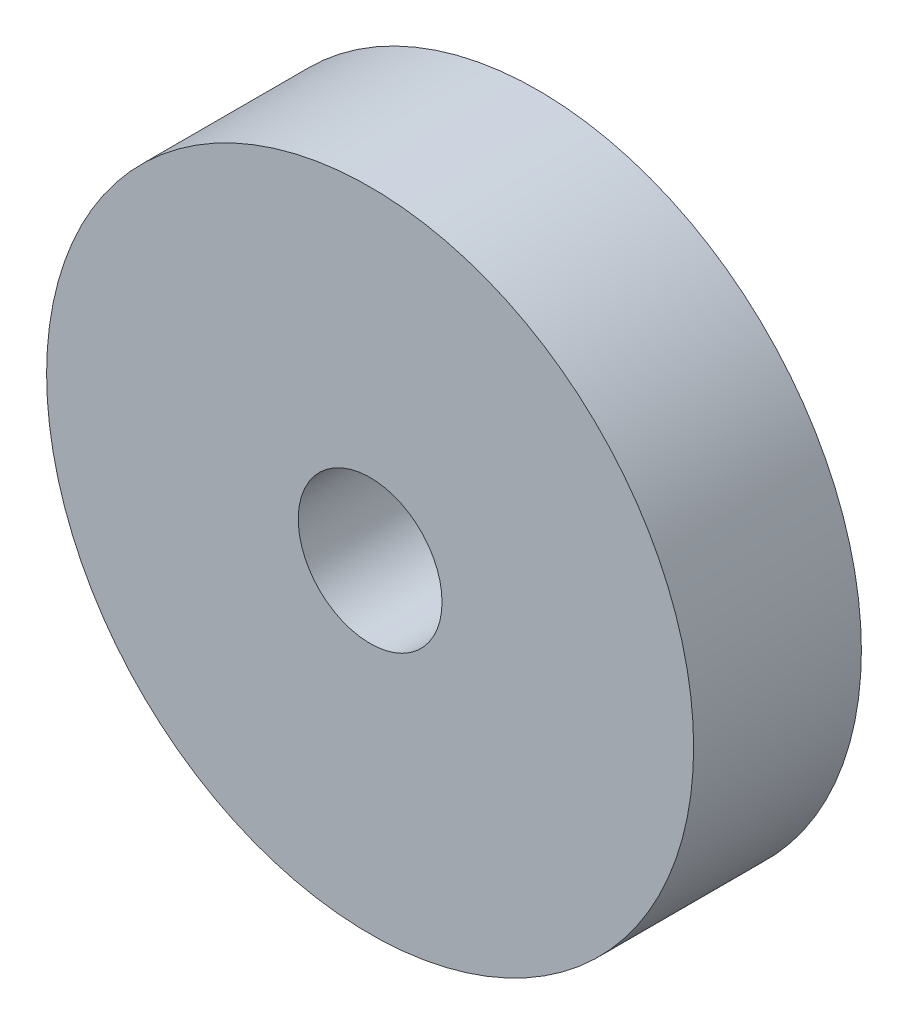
ISO-10303-21;
HEADER;
FILE_DESCRIPTION(('STEP AP214'),'2;1');
FILE_NAME('part.step','',(''),(''),'','','');
FILE_SCHEMA(('AUTOMOTIVE_DESIGN { 1 0 10303 214 1 1 1 1 }'));
ENDSEC;
DATA;
#1=APPLICATION_CONTEXT('core data for automotive mechanical design processes');
#2=APPLICATION_PROTOCOL_DEFINITION('international standard','automotive_design',2000,#1);
#3=PRODUCT_CONTEXT('',#1,'mechanical');
#4=PRODUCT('Part','Part','',(#3));
#5=PRODUCT_RELATED_PRODUCT_CATEGORY('part','',(#4));
#6=PRODUCT_DEFINITION_FORMATION('','',#4);
#7=PRODUCT_DEFINITION_CONTEXT('part definition',#1,'design');
#8=PRODUCT_DEFINITION('design','',#6,#7);
#9=PRODUCT_DEFINITION_SHAPE('','',#8);
#10=(LENGTH_UNIT() NAMED_UNIT(*) SI_UNIT(.MILLI.,.METRE.));
#11=(NAMED_UNIT(*) PLANE_ANGLE_UNIT() SI_UNIT($,.RADIAN.));
#12=(NAMED_UNIT(*) SI_UNIT($,.STERADIAN.) SOLID_ANGLE_UNIT());
#13=UNCERTAINTY_MEASURE_WITH_UNIT(LENGTH_MEASURE(1.E-05),#10,'distance_accuracy_value','');
#14=(GEOMETRIC_REPRESENTATION_CONTEXT(3) GLOBAL_UNCERTAINTY_ASSIGNED_CONTEXT((#13)) GLOBAL_UNIT_ASSIGNED_CONTEXT((#10,
#11,#12)) REPRESENTATION_CONTEXT('',''));
#15=CARTESIAN_POINT('',(0.,0.,0.));
#16=DIRECTION('',(0.,0.,1.));
#17=DIRECTION('',(1.,0.,0.));
#18=AXIS2_PLACEMENT_3D('',#15,#16,#17);
#19=CARTESIAN_POINT('',(0.,0.,3.5));
#20=DIRECTION('',(0.,0.,1.));
#21=DIRECTION('',(1.,0.,0.));
#22=AXIS2_PLACEMENT_3D('',#19,#20,#21);
#23=PLANE('',#22);
#24=CARTESIAN_POINT('',(0.,0.,3.5));
#25=DIRECTION('',(0.,0.,1.));
#26=DIRECTION('',(1.,0.,0.));
#27=AXIS2_PLACEMENT_3D('',#24,#25,#26);
#28=CIRCLE('',#27,3.);
#29=CARTESIAN_POINT('',(3.,0.,3.5));
#30=VERTEX_POINT('',#29);
#31=EDGE_CURVE('E30',#30,#30,#28,.T.);
#32=ORIENTED_EDGE('',*,*,#31,.F.);
#33=EDGE_LOOP('',(#32));
#34=FACE_BOUND('',#33,.T.);
#35=CARTESIAN_POINT('',(0.,0.,3.5));
#36=DIRECTION('',(0.,0.,-1.));
#37=DIRECTION('',(-1.,0.,0.));
#38=AXIS2_PLACEMENT_3D('',#35,#36,#37);
#39=CIRCLE('',#38,13.5);
#40=CARTESIAN_POINT('',(-13.5,0.,3.5));
#41=VERTEX_POINT('',#40);
#42=EDGE_CURVE('E10',#41,#41,#39,.T.);
#43=ORIENTED_EDGE('',*,*,#42,.F.);
#44=EDGE_LOOP('',(#43));
#45=FACE_BOUND('',#44,.T.);
#46=ADVANCED_FACE('F15',(#34,#45),#23,.T.);
#47=CARTESIAN_POINT('',(0.,0.,-3.5));
#48=DIRECTION('',(0.,0.,-1.));
#49=DIRECTION('',(-1.,0.,0.));
#50=AXIS2_PLACEMENT_3D('',#47,#48,#49);
#51=PLANE('',#50);
#52=CARTESIAN_POINT('',(0.,0.,-3.5));
#53=DIRECTION('',(0.,0.,-1.));
#54=DIRECTION('',(-1.,0.,0.));
#55=AXIS2_PLACEMENT_3D('',#52,#53,#54);
#56=CIRCLE('',#55,3.);
#57=CARTESIAN_POINT('',(-3.,0.,-3.5));
#58=VERTEX_POINT('',#57);
#59=EDGE_CURVE('E19',#58,#58,#56,.T.);
#60=ORIENTED_EDGE('',*,*,#59,.F.);
#61=EDGE_LOOP('',(#60));
#62=FACE_BOUND('',#61,.T.);
#63=CARTESIAN_POINT('',(0.,0.,-3.5));
#64=DIRECTION('',(0.,0.,1.));
#65=DIRECTION('',(1.,0.,0.));
#66=AXIS2_PLACEMENT_3D('',#63,#64,#65);
#67=CIRCLE('',#66,13.5);
#68=CARTESIAN_POINT('',(13.5,0.,-3.5));
#69=VERTEX_POINT('',#68);
#70=EDGE_CURVE('E23',#69,#69,#67,.T.);
#71=ORIENTED_EDGE('',*,*,#70,.F.);
#72=EDGE_LOOP('',(#71));
#73=FACE_BOUND('',#72,.T.);
#74=ADVANCED_FACE('F36',(#62,#73),#51,.T.);
#75=CARTESIAN_POINT('',(0.,0.,-3.5));
#76=DIRECTION('',(0.,0.,1.));
#77=DIRECTION('',(1.,0.,0.));
#78=AXIS2_PLACEMENT_3D('',#75,#76,#77);
#79=CYLINDRICAL_SURFACE('',#78,13.5);
#80=ORIENTED_EDGE('',*,*,#42,.T.);
#81=EDGE_LOOP('',(#80));
#82=FACE_BOUND('',#81,.T.);
#83=ORIENTED_EDGE('',*,*,#70,.T.);
#84=EDGE_LOOP('',(#83));
#85=FACE_BOUND('',#84,.T.);
#86=ADVANCED_FACE('F17',(#82,#85),#79,.T.);
#87=CARTESIAN_POINT('',(0.,0.,-4.5));
#88=DIRECTION('',(0.,0.,1.));
#89=DIRECTION('',(1.,0.,0.));
#90=AXIS2_PLACEMENT_3D('',#87,#88,#89);
#91=CYLINDRICAL_SURFACE('',#90,3.);
#92=ORIENTED_EDGE('',*,*,#31,.T.);
#93=EDGE_LOOP('',(#92));
#94=FACE_BOUND('',#93,.T.);
#95=ORIENTED_EDGE('',*,*,#59,.T.);
#96=EDGE_LOOP('',(#95));
#97=FACE_BOUND('',#96,.T.);
#98=ADVANCED_FACE('F38',(#94,#97),#91,.F.);
#99=CLOSED_SHELL('',(#46,#74,#86,#98));
#100=MANIFOLD_SOLID_BREP('B1',#99);
#101=ADVANCED_BREP_SHAPE_REPRESENTATION('',(#18,#100),#14);
#102=SHAPE_DEFINITION_REPRESENTATION(#9,#101);
ENDSEC;
END-ISO-10303-21;
